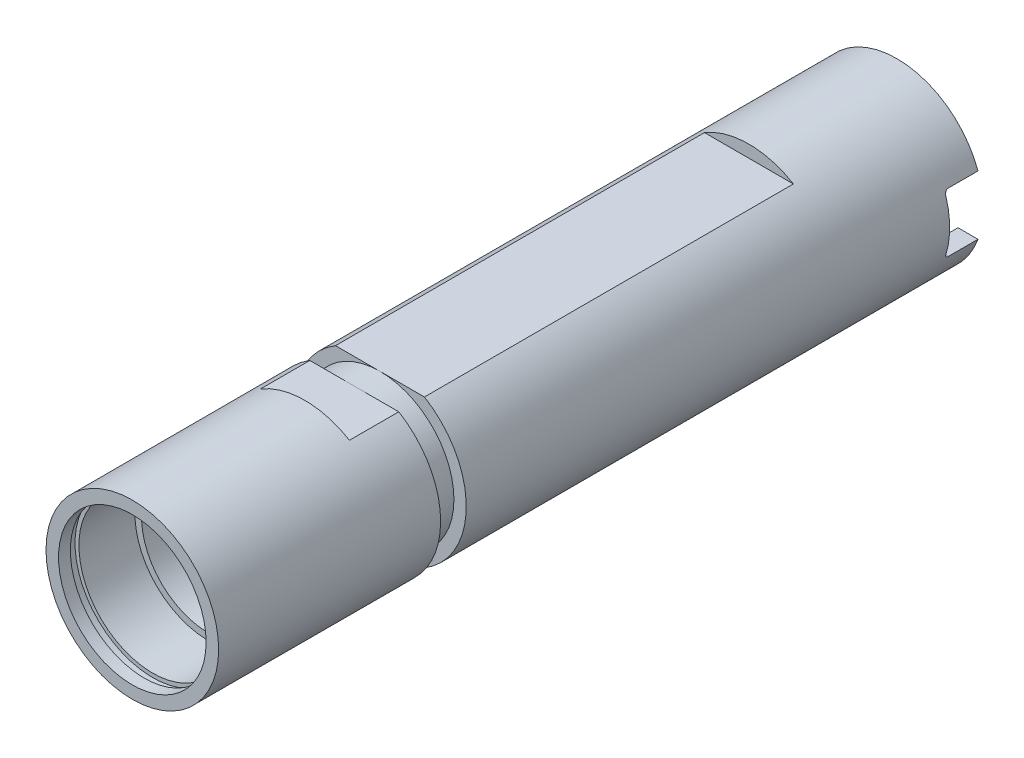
ISO-10303-21;
HEADER;
FILE_DESCRIPTION(('STEP AP214'),'2;1');
FILE_NAME('part.step','',(''),(''),'','','');
FILE_SCHEMA(('AUTOMOTIVE_DESIGN { 1 0 10303 214 1 1 1 1 }'));
ENDSEC;
DATA;
#1=APPLICATION_CONTEXT('core data for automotive mechanical design processes');
#2=APPLICATION_PROTOCOL_DEFINITION('international standard','automotive_design',2000,#1);
#3=PRODUCT_CONTEXT('',#1,'mechanical');
#4=PRODUCT('Part','Part','',(#3));
#5=PRODUCT_RELATED_PRODUCT_CATEGORY('part','',(#4));
#6=PRODUCT_DEFINITION_FORMATION('','',#4);
#7=PRODUCT_DEFINITION_CONTEXT('part definition',#1,'design');
#8=PRODUCT_DEFINITION('design','',#6,#7);
#9=PRODUCT_DEFINITION_SHAPE('','',#8);
#10=(LENGTH_UNIT() NAMED_UNIT(*) SI_UNIT(.MILLI.,.METRE.));
#11=(NAMED_UNIT(*) PLANE_ANGLE_UNIT() SI_UNIT($,.RADIAN.));
#12=(NAMED_UNIT(*) SI_UNIT($,.STERADIAN.) SOLID_ANGLE_UNIT());
#13=UNCERTAINTY_MEASURE_WITH_UNIT(LENGTH_MEASURE(1.E-05),#10,'distance_accuracy_value','');
#14=(GEOMETRIC_REPRESENTATION_CONTEXT(3) GLOBAL_UNCERTAINTY_ASSIGNED_CONTEXT((#13)) GLOBAL_UNIT_ASSIGNED_CONTEXT((#10,
#11,#12)) REPRESENTATION_CONTEXT('',''));
#15=CARTESIAN_POINT('',(0.,0.,0.));
#16=DIRECTION('',(0.,0.,1.));
#17=DIRECTION('',(1.,0.,0.));
#18=AXIS2_PLACEMENT_3D('',#15,#16,#17);
#19=CARTESIAN_POINT('',(0.,8.7376,-98.425));
#20=DIRECTION('',(0.,0.,1.));
#21=DIRECTION('',(1.,0.,0.));
#22=AXIS2_PLACEMENT_3D('',#19,#20,#21);
#23=PLANE('',#22);
#24=DIRECTION('',(-1.,0.,0.));
#25=VECTOR('',#24,1.);
#26=CARTESIAN_POINT('',(11.1125,3.81,-98.425));
#27=LINE('',#26,#25);
#28=CARTESIAN_POINT('',(10.4389442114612,3.81,-98.425));
#29=VERTEX_POINT('',#28);
#30=CARTESIAN_POINT('',(7.86317707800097,3.81,-98.425));
#31=VERTEX_POINT('',#30);
#32=EDGE_CURVE('E184',#29,#31,#27,.T.);
#33=ORIENTED_EDGE('',*,*,#32,.T.);
#34=CARTESIAN_POINT('',(0.,0.,-98.425));
#35=DIRECTION('',(0.,0.,1.));
#36=DIRECTION('',(1.,0.,0.));
#37=AXIS2_PLACEMENT_3D('',#34,#35,#36);
#38=CIRCLE('',#37,8.7376);
#39=CARTESIAN_POINT('',(7.86317707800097,-3.81000000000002,-98.425));
#40=VERTEX_POINT('',#39);
#41=EDGE_CURVE('E183',#31,#40,#38,.T.);
#42=ORIENTED_EDGE('',*,*,#41,.T.);
#43=DIRECTION('',(-1.,0.,0.));
#44=VECTOR('',#43,1.);
#45=CARTESIAN_POINT('',(11.1125,-3.81,-98.425));
#46=LINE('',#45,#44);
#47=CARTESIAN_POINT('',(10.4389442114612,-3.81,-98.425));
#48=VERTEX_POINT('',#47);
#49=EDGE_CURVE('E168',#48,#40,#46,.T.);
#50=ORIENTED_EDGE('',*,*,#49,.F.);
#51=CARTESIAN_POINT('',(0.,0.,-98.425));
#52=DIRECTION('',(0.,0.,1.));
#53=DIRECTION('',(1.,0.,0.));
#54=AXIS2_PLACEMENT_3D('',#51,#52,#53);
#55=CIRCLE('',#54,11.1125);
#56=EDGE_CURVE('E181',#29,#48,#55,.T.);
#57=ORIENTED_EDGE('',*,*,#56,.F.);
#58=EDGE_LOOP('',(#33,#42,#50,#57));
#59=FACE_BOUND('',#58,.T.);
#60=ADVANCED_FACE('F33',(#59),#23,.F.);
#61=CARTESIAN_POINT('',(0.,0.,67.4380733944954));
#62=DIRECTION('',(0.,0.,1.));
#63=DIRECTION('',(1.,0.,0.));
#64=AXIS2_PLACEMENT_3D('',#61,#62,#63);
#65=CYLINDRICAL_SURFACE('',#64,11.1125);
#66=CARTESIAN_POINT('',(0.,0.,-79.375));
#67=DIRECTION('',(0.,0.,-1.));
#68=DIRECTION('',(-1.,0.,0.));
#69=AXIS2_PLACEMENT_3D('',#66,#67,#68);
#70=CIRCLE('',#69,11.1125);
#71=CARTESIAN_POINT('',(5.72381264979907,-9.525,-79.375));
#72=VERTEX_POINT('',#71);
#73=CARTESIAN_POINT('',(-5.72381264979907,-9.525,-79.375));
#74=VERTEX_POINT('',#73);
#75=EDGE_CURVE('E215',#72,#74,#70,.T.);
#76=ORIENTED_EDGE('',*,*,#75,.T.);
#77=DIRECTION('',(0.,0.,1.));
#78=VECTOR('',#77,1.);
#79=CARTESIAN_POINT('',(-5.72381264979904,-9.52500000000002,67.4380733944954));
#80=LINE('',#79,#78);
#81=CARTESIAN_POINT('',(-5.72381264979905,-9.52500000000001,-31.877));
#82=VERTEX_POINT('',#81);
#83=EDGE_CURVE('E433',#74,#82,#80,.T.);
#84=ORIENTED_EDGE('',*,*,#83,.T.);
#85=CARTESIAN_POINT('',(0.,0.,-31.877));
#86=DIRECTION('',(0.,0.,1.));
#87=DIRECTION('',(1.,0.,0.));
#88=AXIS2_PLACEMENT_3D('',#85,#86,#87);
#89=CIRCLE('',#88,11.1125);
#90=CARTESIAN_POINT('',(-5.72381264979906,9.52500000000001,-31.877));
#91=VERTEX_POINT('',#90);
#92=EDGE_CURVE('E189',#91,#82,#89,.T.);
#93=ORIENTED_EDGE('',*,*,#92,.F.);
#94=DIRECTION('',(0.,0.,1.));
#95=VECTOR('',#94,1.);
#96=CARTESIAN_POINT('',(-5.72381264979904,9.52500000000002,67.4380733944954));
#97=LINE('',#96,#95);
#98=CARTESIAN_POINT('',(-5.72381264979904,9.525,-79.375));
#99=VERTEX_POINT('',#98);
#100=EDGE_CURVE('E423',#91,#99,#97,.F.);
#101=ORIENTED_EDGE('',*,*,#100,.T.);
#102=CARTESIAN_POINT('',(0.,0.,-79.375));
#103=DIRECTION('',(0.,0.,-1.));
#104=DIRECTION('',(-1.,0.,0.));
#105=AXIS2_PLACEMENT_3D('',#102,#103,#104);
#106=CIRCLE('',#105,11.1125);
#107=CARTESIAN_POINT('',(5.72381264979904,9.525,-79.375));
#108=VERTEX_POINT('',#107);
#109=EDGE_CURVE('E204',#99,#108,#106,.T.);
#110=ORIENTED_EDGE('',*,*,#109,.T.);
#111=DIRECTION('',(0.,0.,1.));
#112=VECTOR('',#111,1.);
#113=CARTESIAN_POINT('',(5.72381264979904,9.52500000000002,67.4380733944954));
#114=LINE('',#113,#112);
#115=CARTESIAN_POINT('',(5.72381264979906,9.52500000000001,-31.877));
#116=VERTEX_POINT('',#115);
#117=EDGE_CURVE('E425',#108,#116,#114,.T.);
#118=ORIENTED_EDGE('',*,*,#117,.T.);
#119=CARTESIAN_POINT('',(5.72381264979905,-9.52500000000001,-31.877));
#120=VERTEX_POINT('',#119);
#121=EDGE_CURVE('E195',#120,#116,#89,.T.);
#122=ORIENTED_EDGE('',*,*,#121,.F.);
#123=DIRECTION('',(0.,0.,1.));
#124=VECTOR('',#123,1.);
#125=CARTESIAN_POINT('',(5.72381264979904,-9.52500000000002,67.4380733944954));
#126=LINE('',#125,#124);
#127=EDGE_CURVE('E440',#120,#72,#126,.F.);
#128=ORIENTED_EDGE('',*,*,#127,.T.);
#129=EDGE_LOOP('',(#76,#84,#93,#101,#110,#118,#122,#128));
#130=FACE_BOUND('',#129,.T.);
#131=DIRECTION('',(0.,0.,1.));
#132=VECTOR('',#131,1.);
#133=CARTESIAN_POINT('',(10.4389442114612,3.81000000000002,67.4380733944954));
#134=LINE('',#133,#132);
#135=CARTESIAN_POINT('',(10.4389442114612,3.81000000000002,-94.615));
#136=VERTEX_POINT('',#135);
#137=EDGE_CURVE('E187',#29,#136,#134,.T.);
#138=ORIENTED_EDGE('',*,*,#137,.F.);
#139=ORIENTED_EDGE('',*,*,#56,.T.);
#140=DIRECTION('',(0.,0.,1.));
#141=VECTOR('',#140,1.);
#142=CARTESIAN_POINT('',(10.4389442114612,-3.81000000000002,67.4380733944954));
#143=LINE('',#142,#141);
#144=CARTESIAN_POINT('',(10.4389442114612,-3.81000000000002,-94.615));
#145=VERTEX_POINT('',#144);
#146=EDGE_CURVE('E164',#145,#48,#143,.F.);
#147=ORIENTED_EDGE('',*,*,#146,.F.);
#148=CARTESIAN_POINT('',(10.4389442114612,-3.81,-94.615));
#149=CARTESIAN_POINT('',(10.4389304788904,-3.81002917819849,-94.5876165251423));
#150=CARTESIAN_POINT('',(10.4397515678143,-3.80778787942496,-94.5602517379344));
#151=CARTESIAN_POINT('',(10.4429568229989,-3.79899298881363,-94.5063879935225));
#152=CARTESIAN_POINT('',(10.4453369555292,-3.79245052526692,-94.4798869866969));
#153=CARTESIAN_POINT('',(10.4515541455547,-3.77528145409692,-94.4284351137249));
#154=CARTESIAN_POINT('',(10.4553909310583,-3.76465560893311,-94.4034839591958));
#155=CARTESIAN_POINT('',(10.4643429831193,-3.73970032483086,-94.3557558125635));
#156=CARTESIAN_POINT('',(10.4694586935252,-3.72536960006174,-94.332979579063));
#157=CARTESIAN_POINT('',(10.4809141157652,-3.6930200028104,-94.2895452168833));
#158=CARTESIAN_POINT('',(10.487283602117,-3.6749105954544,-94.268962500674));
#159=CARTESIAN_POINT('',(10.500905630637,-3.63580330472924,-94.2310981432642));
#160=CARTESIAN_POINT('',(10.5081584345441,-3.61480456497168,-94.2138174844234));
#161=CARTESIAN_POINT('',(10.5237274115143,-3.56923360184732,-94.1820278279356));
#162=CARTESIAN_POINT('',(10.5320804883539,-3.544526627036,-94.1677301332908));
#163=CARTESIAN_POINT('',(10.5492163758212,-3.49319655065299,-94.143498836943));
#164=CARTESIAN_POINT('',(10.5579991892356,-3.46657343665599,-94.1335652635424));
#165=CARTESIAN_POINT('',(10.5741326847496,-3.41700518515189,-94.1196453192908));
#166=CARTESIAN_POINT('',(10.5814573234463,-3.39425808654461,-94.1149113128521));
#167=CARTESIAN_POINT('',(10.5960743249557,-3.3483510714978,-94.1085880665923));
#168=CARTESIAN_POINT('',(10.6033667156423,-3.32519167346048,-94.1069951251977));
#169=CARTESIAN_POINT('',(10.6105820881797,-3.302,-94.107));
#170=B_SPLINE_CURVE_WITH_KNOTS('',3,(#148,#149,#150,#151,#152,#153,#154,#155,#156,#157,#158,
#159,#160,#161,#162,#163,#164,#165,#166,#167,#168,#169),.UNSPECIFIED.,.F.,.F.,(4,2,2,2,2,2,2,2,
2,2,4),(0.,0.0820176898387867,0.163824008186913,0.245615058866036,0.327434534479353,
0.411502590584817,0.49559561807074,0.584431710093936,0.673268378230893,0.746152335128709,
0.818950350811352),.UNSPECIFIED.);
#171=CARTESIAN_POINT('',(10.6105820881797,-3.302,-94.107));
#172=VERTEX_POINT('',#171);
#173=EDGE_CURVE('E237',#145,#172,#170,.T.);
#174=ORIENTED_EDGE('',*,*,#173,.T.);
#175=CARTESIAN_POINT('',(0.,0.,-94.107));
#176=DIRECTION('',(0.,0.,-1.));
#177=DIRECTION('',(-1.,0.,0.));
#178=AXIS2_PLACEMENT_3D('',#175,#176,#177);
#179=CIRCLE('',#178,11.1125);
#180=CARTESIAN_POINT('',(10.6105820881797,3.302,-94.107));
#181=VERTEX_POINT('',#180);
#182=EDGE_CURVE('E343',#181,#172,#179,.T.);
#183=ORIENTED_EDGE('',*,*,#182,.F.);
#184=CARTESIAN_POINT('',(10.6105820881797,3.302,-94.107));
#185=CARTESIAN_POINT('',(10.6012948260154,3.3318605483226,-94.1069825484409));
#186=CARTESIAN_POINT('',(10.5918736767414,3.36167347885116,-94.1096317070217));
#187=CARTESIAN_POINT('',(10.5730531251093,3.42039836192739,-94.1200951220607));
#188=CARTESIAN_POINT('',(10.5636537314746,3.44930999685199,-94.1279111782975));
#189=CARTESIAN_POINT('',(10.5451673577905,3.50542200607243,-94.1485464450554));
#190=CARTESIAN_POINT('',(10.5360805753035,3.53262130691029,-94.1613687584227));
#191=CARTESIAN_POINT('',(10.5185506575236,3.5844798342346,-94.1917143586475));
#192=CARTESIAN_POINT('',(10.510107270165,3.60914005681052,-94.2092357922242));
#193=CARTESIAN_POINT('',(10.4943307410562,3.65475758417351,-94.2482414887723));
#194=CARTESIAN_POINT('',(10.4869814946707,3.67576956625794,-94.2696551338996));
#195=CARTESIAN_POINT('',(10.4735551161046,3.71385356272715,-94.3160993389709));
#196=CARTESIAN_POINT('',(10.4674779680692,3.73092562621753,-94.3411298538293));
#197=CARTESIAN_POINT('',(10.4571746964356,3.75970427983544,-94.3927394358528));
#198=CARTESIAN_POINT('',(10.4528704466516,3.77163872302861,-94.4191759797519));
#199=CARTESIAN_POINT('',(10.445914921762,3.7908605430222,-94.4738742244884));
#200=CARTESIAN_POINT('',(10.4432611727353,3.7981548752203,-94.5021331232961));
#201=CARTESIAN_POINT('',(10.4406535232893,3.80531412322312,-94.5447255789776));
#202=CARTESIAN_POINT('',(10.4400130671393,3.80707048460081,-94.558724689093));
#203=CARTESIAN_POINT('',(10.4391585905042,3.80941268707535,-94.5868133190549));
#204=CARTESIAN_POINT('',(10.4389439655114,3.81000018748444,-94.6009026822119));
#205=CARTESIAN_POINT('',(10.4389442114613,3.81000000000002,-94.615));
#206=B_SPLINE_CURVE_WITH_KNOTS('',3,(#184,#185,#186,#187,#188,#189,#190,#191,#192,#193,#194,
#195,#196,#197,#198,#199,#200,#201,#202,#203,#204,#205),.UNSPECIFIED.,.F.,.F.,(4,2,2,2,2,2,2,2,
2,2,4),(0.,0.0936956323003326,0.187423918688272,0.281210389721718,0.374959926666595,
0.467153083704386,0.55934509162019,0.646870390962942,0.734264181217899,0.77658675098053,
0.818849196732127),.UNSPECIFIED.);
#207=EDGE_CURVE('E11',#181,#136,#206,.T.);
#208=ORIENTED_EDGE('',*,*,#207,.T.);
#209=EDGE_LOOP('',(#138,#139,#147,#174,#183,#208));
#210=FACE_BOUND('',#209,.T.);
#211=ADVANCED_FACE('F186',(#130,#210),#65,.T.);
#212=CARTESIAN_POINT('',(0.,0.,67.4380733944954));
#213=DIRECTION('',(0.,0.,1.));
#214=DIRECTION('',(1.,0.,0.));
#215=AXIS2_PLACEMENT_3D('',#212,#213,#214);
#216=CYLINDRICAL_SURFACE('',#215,9.5631);
#217=DIRECTION('',(0.,0.,1.));
#218=VECTOR('',#217,1.);
#219=CARTESIAN_POINT('',(8.77136144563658,3.81000000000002,67.4380733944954));
#220=LINE('',#219,#218);
#221=CARTESIAN_POINT('',(8.77136144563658,3.81000000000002,-94.615));
#222=VERTEX_POINT('',#221);
#223=CARTESIAN_POINT('',(8.77136144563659,3.81,-95.885));
#224=VERTEX_POINT('',#223);
#225=EDGE_CURVE('E504',#222,#224,#220,.F.);
#226=ORIENTED_EDGE('',*,*,#225,.F.);
#227=CARTESIAN_POINT('',(8.77136144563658,3.81,-94.615));
#228=CARTESIAN_POINT('',(8.77134456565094,3.81003065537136,-94.588048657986));
#229=CARTESIAN_POINT('',(8.77229212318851,3.80785737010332,-94.5611201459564));
#230=CARTESIAN_POINT('',(8.77598321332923,3.7993470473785,-94.5081410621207));
#231=CARTESIAN_POINT('',(8.77872098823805,3.7930233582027,-94.482087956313));
#232=CARTESIAN_POINT('',(8.78585959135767,3.77645717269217,-94.4315209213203));
#233=CARTESIAN_POINT('',(8.79025969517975,3.76621638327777,-94.4070063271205));
#234=CARTESIAN_POINT('',(8.80050822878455,3.74220624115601,-94.3600944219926));
#235=CARTESIAN_POINT('',(8.8063574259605,3.72843501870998,-94.3376982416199));
#236=CARTESIAN_POINT('',(8.81949519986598,3.69725322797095,-94.294735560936));
#237=CARTESIAN_POINT('',(8.82682883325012,3.67972735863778,-94.2742667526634));
#238=CARTESIAN_POINT('',(8.84250104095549,3.64190553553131,-94.2365260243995));
#239=CARTESIAN_POINT('',(8.85083992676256,3.62160872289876,-94.2192550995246));
#240=CARTESIAN_POINT('',(8.86891696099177,3.57712347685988,-94.1870011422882));
#241=CARTESIAN_POINT('',(8.87871345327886,3.55275544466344,-94.1722985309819));
#242=CARTESIAN_POINT('',(8.89882157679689,3.5020850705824,-94.1472077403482));
#243=CARTESIAN_POINT('',(8.90913331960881,3.47578230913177,-94.1368205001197));
#244=CARTESIAN_POINT('',(8.92874997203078,3.42504794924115,-94.1215012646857));
#245=CARTESIAN_POINT('',(8.93803222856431,3.40075533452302,-94.1160747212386));
#246=CARTESIAN_POINT('',(8.95656069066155,3.35165687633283,-94.1088233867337));
#247=CARTESIAN_POINT('',(8.96580692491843,3.32685163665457,-94.1069945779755));
#248=CARTESIAN_POINT('',(8.97494722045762,3.302,-94.107));
#249=B_SPLINE_CURVE_WITH_KNOTS('',3,(#227,#228,#229,#230,#231,#232,#233,#234,#235,#236,#237,
#238,#239,#240,#241,#242,#243,#244,#245,#246,#247,#248),.UNSPECIFIED.,.F.,.F.,(4,2,2,2,2,2,2,2,
2,2,4),(0.,0.0807143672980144,0.161170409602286,0.241591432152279,0.322055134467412,
0.405480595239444,0.488931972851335,0.578840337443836,0.668768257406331,0.748219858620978,
0.827582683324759),.UNSPECIFIED.);
#250=CARTESIAN_POINT('',(8.97494722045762,3.302,-94.107));
#251=VERTEX_POINT('',#250);
#252=EDGE_CURVE('E47',#222,#251,#249,.T.);
#253=ORIENTED_EDGE('',*,*,#252,.T.);
#254=CARTESIAN_POINT('',(0.,0.,-94.107));
#255=DIRECTION('',(0.,0.,1.));
#256=DIRECTION('',(1.,0.,0.));
#257=AXIS2_PLACEMENT_3D('',#254,#255,#256);
#258=CIRCLE('',#257,9.5631);
#259=CARTESIAN_POINT('',(8.97494722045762,-3.302,-94.107));
#260=VERTEX_POINT('',#259);
#261=EDGE_CURVE('E349',#251,#260,#258,.T.);
#262=ORIENTED_EDGE('',*,*,#261,.T.);
#263=CARTESIAN_POINT('',(8.97494722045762,-3.302,-94.107));
#264=CARTESIAN_POINT('',(8.9637780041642,-3.3323765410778,-94.1069856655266));
#265=CARTESIAN_POINT('',(8.95244472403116,-3.36268720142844,-94.1097236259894));
#266=CARTESIAN_POINT('',(8.92979370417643,-3.42237545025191,-94.1205402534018));
#267=CARTESIAN_POINT('',(8.91847598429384,-3.45175226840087,-94.1286232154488));
#268=CARTESIAN_POINT('',(8.89621145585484,-3.50873894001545,-94.1499725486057));
#269=CARTESIAN_POINT('',(8.88526489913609,-3.53634760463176,-94.1632423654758));
#270=CARTESIAN_POINT('',(8.864151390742,-3.58894170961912,-94.1946834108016));
#271=CARTESIAN_POINT('',(8.85398407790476,-3.61392836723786,-94.2128523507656));
#272=CARTESIAN_POINT('',(8.83507947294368,-3.65989850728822,-94.2532180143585));
#273=CARTESIAN_POINT('',(8.82631405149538,-3.68096267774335,-94.2753093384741));
#274=CARTESIAN_POINT('',(8.81035104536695,-3.71900831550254,-94.3232746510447));
#275=CARTESIAN_POINT('',(8.80315324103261,-3.73599035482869,-94.3491481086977));
#276=CARTESIAN_POINT('',(8.79117838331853,-3.76407779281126,-94.4019755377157));
#277=CARTESIAN_POINT('',(8.78626587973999,-3.77551448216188,-94.4287228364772));
#278=CARTESIAN_POINT('',(8.77843671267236,-3.79368291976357,-94.4840233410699));
#279=CARTESIAN_POINT('',(8.77551629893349,-3.80042350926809,-94.5125730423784));
#280=CARTESIAN_POINT('',(8.77290893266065,-3.80643577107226,-94.5536764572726));
#281=CARTESIAN_POINT('',(8.7723289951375,-3.80777189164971,-94.5659042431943));
#282=CARTESIAN_POINT('',(8.77155554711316,-3.80955320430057,-94.590419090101));
#283=CARTESIAN_POINT('',(8.77136148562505,-3.80999966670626,-94.6027060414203));
#284=CARTESIAN_POINT('',(8.77136144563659,-3.81,-94.615));
#285=B_SPLINE_CURVE_WITH_KNOTS('',3,(#263,#264,#265,#266,#267,#268,#269,#270,#271,#272,#273,
#274,#275,#276,#277,#278,#279,#280,#281,#282,#283,#284),.UNSPECIFIED.,.F.,.F.,(4,2,2,2,2,2,2,2,
2,2,4),(0.,0.0969735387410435,0.194025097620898,0.291141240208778,0.38821209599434,
0.482987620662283,0.577749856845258,0.66579338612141,0.753670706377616,0.790581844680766,
0.827440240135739),.UNSPECIFIED.);
#286=CARTESIAN_POINT('',(8.77136144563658,-3.81000000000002,-94.615));
#287=VERTEX_POINT('',#286);
#288=EDGE_CURVE('E230',#260,#287,#285,.T.);
#289=ORIENTED_EDGE('',*,*,#288,.T.);
#290=DIRECTION('',(0.,0.,1.));
#291=VECTOR('',#290,1.);
#292=CARTESIAN_POINT('',(8.77136144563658,-3.81000000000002,67.4380733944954));
#293=LINE('',#292,#291);
#294=CARTESIAN_POINT('',(8.77136144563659,-3.81,-95.885));
#295=VERTEX_POINT('',#294);
#296=EDGE_CURVE('E175',#295,#287,#293,.T.);
#297=ORIENTED_EDGE('',*,*,#296,.F.);
#298=CARTESIAN_POINT('',(0.,0.,-95.885));
#299=DIRECTION('',(0.,0.,1.));
#300=DIRECTION('',(1.,0.,0.));
#301=AXIS2_PLACEMENT_3D('',#298,#299,#300);
#302=CIRCLE('',#301,9.5631);
#303=EDGE_CURVE('E354',#224,#295,#302,.T.);
#304=ORIENTED_EDGE('',*,*,#303,.F.);
#305=EDGE_LOOP('',(#226,#253,#262,#289,#297,#304));
#306=FACE_BOUND('',#305,.T.);
#307=ADVANCED_FACE('F242',(#306),#216,.F.);
#308=CARTESIAN_POINT('',(0.,9.5631,-95.885));
#309=DIRECTION('',(0.,0.,-1.));
#310=DIRECTION('',(-1.,0.,0.));
#311=AXIS2_PLACEMENT_3D('',#308,#309,#310);
#312=PLANE('',#311);
#313=DIRECTION('',(-1.,0.,0.));
#314=VECTOR('',#313,1.);
#315=CARTESIAN_POINT('',(0.,3.81,-95.885));
#316=LINE('',#315,#314);
#317=CARTESIAN_POINT('',(7.86317707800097,3.81000000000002,-95.885));
#318=VERTEX_POINT('',#317);
#319=EDGE_CURVE('E174',#224,#318,#316,.T.);
#320=ORIENTED_EDGE('',*,*,#319,.F.);
#321=ORIENTED_EDGE('',*,*,#303,.T.);
#322=DIRECTION('',(1.,0.,0.));
#323=VECTOR('',#322,1.);
#324=CARTESIAN_POINT('',(0.,-3.81,-95.885));
#325=LINE('',#324,#323);
#326=CARTESIAN_POINT('',(7.86317707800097,-3.81000000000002,-95.885));
#327=VERTEX_POINT('',#326);
#328=EDGE_CURVE('E500',#327,#295,#325,.T.);
#329=ORIENTED_EDGE('',*,*,#328,.F.);
#330=CARTESIAN_POINT('',(0.,0.,-95.885));
#331=DIRECTION('',(0.,0.,1.));
#332=DIRECTION('',(1.,0.,0.));
#333=AXIS2_PLACEMENT_3D('',#330,#331,#332);
#334=CIRCLE('',#333,8.7376);
#335=EDGE_CURVE('E491',#318,#327,#334,.T.);
#336=ORIENTED_EDGE('',*,*,#335,.F.);
#337=EDGE_LOOP('',(#320,#321,#329,#336));
#338=FACE_BOUND('',#337,.T.);
#339=ADVANCED_FACE('F498',(#338),#312,.F.);
#340=CARTESIAN_POINT('',(0.,0.,67.4380733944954));
#341=DIRECTION('',(0.,0.,1.));
#342=DIRECTION('',(1.,0.,0.));
#343=AXIS2_PLACEMENT_3D('',#340,#341,#342);
#344=CYLINDRICAL_SURFACE('',#343,8.7376);
#345=DIRECTION('',(0.,0.,1.));
#346=VECTOR('',#345,1.);
#347=CARTESIAN_POINT('',(7.86317707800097,3.81000000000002,67.4380733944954));
#348=LINE('',#347,#346);
#349=EDGE_CURVE('E220',#318,#31,#348,.F.);
#350=ORIENTED_EDGE('',*,*,#349,.F.);
#351=ORIENTED_EDGE('',*,*,#335,.T.);
#352=DIRECTION('',(0.,0.,1.));
#353=VECTOR('',#352,1.);
#354=CARTESIAN_POINT('',(7.86317707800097,-3.81000000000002,67.4380733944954));
#355=LINE('',#354,#353);
#356=EDGE_CURVE('E218',#40,#327,#355,.T.);
#357=ORIENTED_EDGE('',*,*,#356,.F.);
#358=ORIENTED_EDGE('',*,*,#41,.F.);
#359=EDGE_LOOP('',(#350,#351,#357,#358));
#360=FACE_BOUND('',#359,.T.);
#361=ADVANCED_FACE('F567',(#360),#344,.F.);
#362=CARTESIAN_POINT('',(0.,9.525,-31.877));
#363=DIRECTION('',(0.,0.,1.));
#364=DIRECTION('',(1.,0.,0.));
#365=AXIS2_PLACEMENT_3D('',#362,#363,#364);
#366=PLANE('',#365);
#367=DIRECTION('',(-1.,0.,0.));
#368=VECTOR('',#367,1.);
#369=CARTESIAN_POINT('',(0.,-9.52500000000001,-31.877));
#370=LINE('',#369,#368);
#371=CARTESIAN_POINT('',(0.,-9.525,-31.877));
#372=VERTEX_POINT('',#371);
#373=EDGE_CURVE('E436',#120,#372,#370,.T.);
#374=ORIENTED_EDGE('',*,*,#373,.F.);
#375=ORIENTED_EDGE('',*,*,#121,.T.);
#376=DIRECTION('',(1.,0.,0.));
#377=VECTOR('',#376,1.);
#378=CARTESIAN_POINT('',(0.,9.52500000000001,-31.877));
#379=LINE('',#378,#377);
#380=CARTESIAN_POINT('',(0.,9.525,-31.877));
#381=VERTEX_POINT('',#380);
#382=EDGE_CURVE('E419',#381,#116,#379,.T.);
#383=ORIENTED_EDGE('',*,*,#382,.F.);
#384=CARTESIAN_POINT('',(0.,0.,-31.877));
#385=DIRECTION('',(0.,0.,1.));
#386=DIRECTION('',(1.,0.,0.));
#387=AXIS2_PLACEMENT_3D('',#384,#385,#386);
#388=CIRCLE('',#387,9.525);
#389=EDGE_CURVE('E403',#372,#381,#388,.T.);
#390=ORIENTED_EDGE('',*,*,#389,.F.);
#391=EDGE_LOOP('',(#374,#375,#383,#390));
#392=FACE_BOUND('',#391,.T.);
#393=ADVANCED_FACE('F264',(#392),#366,.T.);
#394=CARTESIAN_POINT('',(0.,11.1125,-28.575));
#395=DIRECTION('',(0.,0.,-1.));
#396=DIRECTION('',(-1.,0.,0.));
#397=AXIS2_PLACEMENT_3D('',#394,#395,#396);
#398=PLANE('',#397);
#399=DIRECTION('',(1.,0.,0.));
#400=VECTOR('',#399,1.);
#401=CARTESIAN_POINT('',(0.,-9.52500000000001,-28.575));
#402=LINE('',#401,#400);
#403=CARTESIAN_POINT('',(-5.72381264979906,-9.52500000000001,-28.575));
#404=VERTEX_POINT('',#403);
#405=CARTESIAN_POINT('',(0.,-9.52500000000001,-28.575));
#406=VERTEX_POINT('',#405);
#407=EDGE_CURVE('E434',#404,#406,#402,.T.);
#408=ORIENTED_EDGE('',*,*,#407,.F.);
#409=CARTESIAN_POINT('',(0.,0.,-28.575));
#410=DIRECTION('',(0.,0.,1.));
#411=DIRECTION('',(1.,0.,0.));
#412=AXIS2_PLACEMENT_3D('',#409,#410,#411);
#413=CIRCLE('',#412,11.1125);
#414=CARTESIAN_POINT('',(-5.72381264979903,9.52500000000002,-28.575));
#415=VERTEX_POINT('',#414);
#416=EDGE_CURVE('E397',#415,#404,#413,.T.);
#417=ORIENTED_EDGE('',*,*,#416,.F.);
#418=DIRECTION('',(-1.,0.,0.));
#419=VECTOR('',#418,1.);
#420=CARTESIAN_POINT('',(0.,9.52500000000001,-28.575));
#421=LINE('',#420,#419);
#422=CARTESIAN_POINT('',(0.,9.52500000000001,-28.575));
#423=VERTEX_POINT('',#422);
#424=EDGE_CURVE('E449',#423,#415,#421,.T.);
#425=ORIENTED_EDGE('',*,*,#424,.F.);
#426=CARTESIAN_POINT('',(0.,0.,-28.575));
#427=DIRECTION('',(0.,0.,1.));
#428=DIRECTION('',(1.,0.,0.));
#429=AXIS2_PLACEMENT_3D('',#426,#427,#428);
#430=CIRCLE('',#429,9.525);
#431=EDGE_CURVE('E401',#423,#406,#430,.T.);
#432=ORIENTED_EDGE('',*,*,#431,.T.);
#433=EDGE_LOOP('',(#408,#417,#425,#432));
#434=FACE_BOUND('',#433,.T.);
#435=ADVANCED_FACE('F262',(#434),#398,.T.);
#436=EDGE_CURVE('E430',#372,#82,#370,.T.);
#437=ORIENTED_EDGE('',*,*,#436,.F.);
#438=EDGE_CURVE('E404',#381,#372,#388,.T.);
#439=ORIENTED_EDGE('',*,*,#438,.F.);
#440=EDGE_CURVE('E416',#91,#381,#379,.T.);
#441=ORIENTED_EDGE('',*,*,#440,.F.);
#442=ORIENTED_EDGE('',*,*,#92,.T.);
#443=EDGE_LOOP('',(#437,#439,#441,#442));
#444=FACE_BOUND('',#443,.T.);
#445=ADVANCED_FACE('F257',(#444),#366,.T.);
#446=CARTESIAN_POINT('',(0.,0.,67.4380733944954));
#447=DIRECTION('',(0.,0.,1.));
#448=DIRECTION('',(1.,0.,0.));
#449=AXIS2_PLACEMENT_3D('',#446,#447,#448);
#450=CYLINDRICAL_SURFACE('',#449,9.525);
#451=ORIENTED_EDGE('',*,*,#438,.T.);
#452=ORIENTED_EDGE('',*,*,#389,.T.);
#453=EDGE_LOOP('',(#451,#452));
#454=FACE_BOUND('',#453,.T.);
#455=ORIENTED_EDGE('',*,*,#431,.F.);
#456=EDGE_CURVE('E400',#406,#423,#430,.T.);
#457=ORIENTED_EDGE('',*,*,#456,.F.);
#458=EDGE_LOOP('',(#455,#457));
#459=FACE_BOUND('',#458,.T.);
#460=ADVANCED_FACE('F261',(#454,#459),#450,.T.);
#461=CARTESIAN_POINT('',(5.72381264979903,-9.52500000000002,-28.575));
#462=VERTEX_POINT('',#461);
#463=EDGE_CURVE('E438',#406,#462,#402,.T.);
#464=ORIENTED_EDGE('',*,*,#463,.F.);
#465=ORIENTED_EDGE('',*,*,#456,.T.);
#466=CARTESIAN_POINT('',(5.72381264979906,9.52500000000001,-28.575));
#467=VERTEX_POINT('',#466);
#468=EDGE_CURVE('E428',#467,#423,#421,.T.);
#469=ORIENTED_EDGE('',*,*,#468,.F.);
#470=EDGE_CURVE('E396',#462,#467,#413,.T.);
#471=ORIENTED_EDGE('',*,*,#470,.F.);
#472=EDGE_LOOP('',(#464,#465,#469,#471));
#473=FACE_BOUND('',#472,.T.);
#474=ADVANCED_FACE('F267',(#473),#398,.T.);
#475=CARTESIAN_POINT('',(0.,0.,67.4380733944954));
#476=DIRECTION('',(0.,0.,1.));
#477=DIRECTION('',(1.,0.,0.));
#478=AXIS2_PLACEMENT_3D('',#475,#476,#477);
#479=CYLINDRICAL_SURFACE('',#478,11.1125);
#480=DIRECTION('',(0.,0.,1.));
#481=VECTOR('',#480,1.);
#482=CARTESIAN_POINT('',(-5.72381264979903,-9.52500000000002,67.4380733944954));
#483=LINE('',#482,#481);
#484=CARTESIAN_POINT('',(-5.72381264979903,-9.52500000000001,-22.225));
#485=VERTEX_POINT('',#484);
#486=EDGE_CURVE('E212',#404,#485,#483,.T.);
#487=ORIENTED_EDGE('',*,*,#486,.T.);
#488=CARTESIAN_POINT('',(0.,0.,-22.225));
#489=DIRECTION('',(0.,0.,1.));
#490=DIRECTION('',(0.,-1.,0.));
#491=AXIS2_PLACEMENT_3D('',#488,#489,#490);
#492=CIRCLE('',#491,11.1125);
#493=CARTESIAN_POINT('',(5.72381264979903,-9.52500000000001,-22.225));
#494=VERTEX_POINT('',#493);
#495=EDGE_CURVE('E209',#485,#494,#492,.T.);
#496=ORIENTED_EDGE('',*,*,#495,.T.);
#497=DIRECTION('',(0.,0.,1.));
#498=VECTOR('',#497,1.);
#499=CARTESIAN_POINT('',(5.72381264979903,-9.52500000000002,67.4380733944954));
#500=LINE('',#499,#498);
#501=EDGE_CURVE('E206',#494,#462,#500,.F.);
#502=ORIENTED_EDGE('',*,*,#501,.T.);
#503=ORIENTED_EDGE('',*,*,#470,.T.);
#504=DIRECTION('',(0.,0.,1.));
#505=VECTOR('',#504,1.);
#506=CARTESIAN_POINT('',(5.72381264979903,9.52500000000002,67.4380733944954));
#507=LINE('',#506,#505);
#508=CARTESIAN_POINT('',(5.72381264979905,9.52500000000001,-22.225));
#509=VERTEX_POINT('',#508);
#510=EDGE_CURVE('E201',#467,#509,#507,.T.);
#511=ORIENTED_EDGE('',*,*,#510,.T.);
#512=CARTESIAN_POINT('',(0.,0.,-22.225));
#513=DIRECTION('',(0.,0.,1.));
#514=DIRECTION('',(0.,-1.,0.));
#515=AXIS2_PLACEMENT_3D('',#512,#513,#514);
#516=CIRCLE('',#515,11.1125);
#517=CARTESIAN_POINT('',(-5.72381264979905,9.52500000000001,-22.225));
#518=VERTEX_POINT('',#517);
#519=EDGE_CURVE('E188',#509,#518,#516,.T.);
#520=ORIENTED_EDGE('',*,*,#519,.T.);
#521=DIRECTION('',(0.,0.,1.));
#522=VECTOR('',#521,1.);
#523=CARTESIAN_POINT('',(-5.72381264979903,9.52500000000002,67.4380733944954));
#524=LINE('',#523,#522);
#525=EDGE_CURVE('E192',#518,#415,#524,.F.);
#526=ORIENTED_EDGE('',*,*,#525,.T.);
#527=ORIENTED_EDGE('',*,*,#416,.T.);
#528=EDGE_LOOP('',(#487,#496,#502,#503,#511,#520,#526,#527));
#529=FACE_BOUND('',#528,.T.);
#530=CARTESIAN_POINT('',(0.,0.,0.));
#531=DIRECTION('',(0.,0.,1.));
#532=DIRECTION('',(1.,0.,0.));
#533=AXIS2_PLACEMENT_3D('',#530,#531,#532);
#534=CIRCLE('',#533,11.1125);
#535=CARTESIAN_POINT('',(11.1125,0.,0.));
#536=VERTEX_POINT('',#535);
#537=EDGE_CURVE('E393',#536,#536,#534,.T.);
#538=ORIENTED_EDGE('',*,*,#537,.F.);
#539=EDGE_LOOP('',(#538));
#540=FACE_BOUND('',#539,.T.);
#541=ADVANCED_FACE('F271',(#529,#540),#479,.T.);
#542=CARTESIAN_POINT('',(0.,11.1125,0.));
#543=DIRECTION('',(0.,0.,-1.));
#544=DIRECTION('',(-1.,0.,0.));
#545=AXIS2_PLACEMENT_3D('',#542,#543,#544);
#546=PLANE('',#545);
#547=CARTESIAN_POINT('',(0.,0.,0.));
#548=DIRECTION('',(0.,0.,1.));
#549=DIRECTION('',(1.,0.,0.));
#550=AXIS2_PLACEMENT_3D('',#547,#548,#549);
#551=CIRCLE('',#550,9.5);
#552=CARTESIAN_POINT('',(9.5,0.,0.));
#553=VERTEX_POINT('',#552);
#554=EDGE_CURVE('E390',#553,#553,#551,.T.);
#555=ORIENTED_EDGE('',*,*,#554,.F.);
#556=EDGE_LOOP('',(#555));
#557=FACE_BOUND('',#556,.T.);
#558=ORIENTED_EDGE('',*,*,#537,.T.);
#559=EDGE_LOOP('',(#558));
#560=FACE_BOUND('',#559,.T.);
#561=ADVANCED_FACE('F275',(#557,#560),#546,.F.);
#562=CARTESIAN_POINT('',(0.,0.,67.4380733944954));
#563=DIRECTION('',(0.,0.,1.));
#564=DIRECTION('',(1.,0.,0.));
#565=AXIS2_PLACEMENT_3D('',#562,#563,#564);
#566=CYLINDRICAL_SURFACE('',#565,9.5);
#567=CARTESIAN_POINT('',(0.,0.,-1.524));
#568=DIRECTION('',(0.,0.,1.));
#569=DIRECTION('',(1.,0.,0.));
#570=AXIS2_PLACEMENT_3D('',#567,#568,#569);
#571=CIRCLE('',#570,9.5);
#572=CARTESIAN_POINT('',(9.5,0.,-1.524));
#573=VERTEX_POINT('',#572);
#574=EDGE_CURVE('E387',#573,#573,#571,.T.);
#575=ORIENTED_EDGE('',*,*,#574,.F.);
#576=EDGE_LOOP('',(#575));
#577=FACE_BOUND('',#576,.T.);
#578=ORIENTED_EDGE('',*,*,#554,.T.);
#579=EDGE_LOOP('',(#578));
#580=FACE_BOUND('',#579,.T.);
#581=ADVANCED_FACE('F279',(#577,#580),#566,.F.);
#582=CARTESIAN_POINT('',(0.,9.5,-1.524));
#583=DIRECTION('',(0.,0.,1.));
#584=DIRECTION('',(1.,0.,0.));
#585=AXIS2_PLACEMENT_3D('',#582,#583,#584);
#586=PLANE('',#585);
#587=CARTESIAN_POINT('',(0.,0.,-1.524));
#588=DIRECTION('',(0.,0.,1.));
#589=DIRECTION('',(1.,0.,0.));
#590=AXIS2_PLACEMENT_3D('',#587,#588,#589);
#591=CIRCLE('',#590,10.);
#592=CARTESIAN_POINT('',(10.,0.,-1.524));
#593=VERTEX_POINT('',#592);
#594=EDGE_CURVE('E384',#593,#593,#591,.T.);
#595=ORIENTED_EDGE('',*,*,#594,.F.);
#596=EDGE_LOOP('',(#595));
#597=FACE_BOUND('',#596,.T.);
#598=ORIENTED_EDGE('',*,*,#574,.T.);
#599=EDGE_LOOP('',(#598));
#600=FACE_BOUND('',#599,.T.);
#601=ADVANCED_FACE('F283',(#597,#600),#586,.F.);
#602=CARTESIAN_POINT('',(0.,0.,67.4380733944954));
#603=DIRECTION('',(0.,0.,1.));
#604=DIRECTION('',(1.,0.,0.));
#605=AXIS2_PLACEMENT_3D('',#602,#603,#604);
#606=CYLINDRICAL_SURFACE('',#605,10.);
#607=CARTESIAN_POINT('',(0.,0.,-2.624));
#608=DIRECTION('',(0.,0.,1.));
#609=DIRECTION('',(1.,0.,0.));
#610=AXIS2_PLACEMENT_3D('',#607,#608,#609);
#611=CIRCLE('',#610,10.);
#612=CARTESIAN_POINT('',(10.,0.,-2.624));
#613=VERTEX_POINT('',#612);
#614=EDGE_CURVE('E381',#613,#613,#611,.T.);
#615=ORIENTED_EDGE('',*,*,#614,.F.);
#616=EDGE_LOOP('',(#615));
#617=FACE_BOUND('',#616,.T.);
#618=ORIENTED_EDGE('',*,*,#594,.T.);
#619=EDGE_LOOP('',(#618));
#620=FACE_BOUND('',#619,.T.);
#621=ADVANCED_FACE('F287',(#617,#620),#606,.F.);
#622=CARTESIAN_POINT('',(0.,10.,-2.624));
#623=DIRECTION('',(0.,0.,-1.));
#624=DIRECTION('',(-1.,0.,0.));
#625=AXIS2_PLACEMENT_3D('',#622,#623,#624);
#626=PLANE('',#625);
#627=CARTESIAN_POINT('',(0.,0.,-2.624));
#628=DIRECTION('',(0.,0.,1.));
#629=DIRECTION('',(1.,0.,0.));
#630=AXIS2_PLACEMENT_3D('',#627,#628,#629);
#631=CIRCLE('',#630,9.5);
#632=CARTESIAN_POINT('',(9.5,0.,-2.624));
#633=VERTEX_POINT('',#632);
#634=EDGE_CURVE('E378',#633,#633,#631,.T.);
#635=ORIENTED_EDGE('',*,*,#634,.F.);
#636=EDGE_LOOP('',(#635));
#637=FACE_BOUND('',#636,.T.);
#638=ORIENTED_EDGE('',*,*,#614,.T.);
#639=EDGE_LOOP('',(#638));
#640=FACE_BOUND('',#639,.T.);
#641=ADVANCED_FACE('F291',(#637,#640),#626,.F.);
#642=CARTESIAN_POINT('',(0.,0.,67.4380733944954));
#643=DIRECTION('',(0.,0.,1.));
#644=DIRECTION('',(1.,0.,0.));
#645=AXIS2_PLACEMENT_3D('',#642,#643,#644);
#646=CYLINDRICAL_SURFACE('',#645,9.5);
#647=CARTESIAN_POINT('',(0.,0.,-9.824));
#648=DIRECTION('',(0.,0.,1.));
#649=DIRECTION('',(1.,0.,0.));
#650=AXIS2_PLACEMENT_3D('',#647,#648,#649);
#651=CIRCLE('',#650,9.5);
#652=CARTESIAN_POINT('',(9.5,0.,-9.824));
#653=VERTEX_POINT('',#652);
#654=EDGE_CURVE('E375',#653,#653,#651,.T.);
#655=ORIENTED_EDGE('',*,*,#654,.F.);
#656=EDGE_LOOP('',(#655));
#657=FACE_BOUND('',#656,.T.);
#658=ORIENTED_EDGE('',*,*,#634,.T.);
#659=EDGE_LOOP('',(#658));
#660=FACE_BOUND('',#659,.T.);
#661=ADVANCED_FACE('F295',(#657,#660),#646,.F.);
#662=CARTESIAN_POINT('',(0.,9.5,-9.824));
#663=DIRECTION('',(0.,0.,-1.));
#664=DIRECTION('',(-1.,0.,0.));
#665=AXIS2_PLACEMENT_3D('',#662,#663,#664);
#666=PLANE('',#665);
#667=CARTESIAN_POINT('',(0.,0.,-9.824));
#668=DIRECTION('',(0.,0.,1.));
#669=DIRECTION('',(1.,0.,0.));
#670=AXIS2_PLACEMENT_3D('',#667,#668,#669);
#671=CIRCLE('',#670,8.636);
#672=CARTESIAN_POINT('',(8.636,0.,-9.824));
#673=VERTEX_POINT('',#672);
#674=EDGE_CURVE('E372',#673,#673,#671,.T.);
#675=ORIENTED_EDGE('',*,*,#674,.F.);
#676=EDGE_LOOP('',(#675));
#677=FACE_BOUND('',#676,.T.);
#678=ORIENTED_EDGE('',*,*,#654,.T.);
#679=EDGE_LOOP('',(#678));
#680=FACE_BOUND('',#679,.T.);
#681=ADVANCED_FACE('F299',(#677,#680),#666,.F.);
#682=CARTESIAN_POINT('',(0.,0.,67.4380733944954));
#683=DIRECTION('',(0.,0.,1.));
#684=DIRECTION('',(1.,0.,0.));
#685=AXIS2_PLACEMENT_3D('',#682,#683,#684);
#686=CYLINDRICAL_SURFACE('',#685,8.636);
#687=CARTESIAN_POINT('',(0.,0.,-16.174));
#688=DIRECTION('',(0.,0.,1.));
#689=DIRECTION('',(1.,0.,0.));
#690=AXIS2_PLACEMENT_3D('',#687,#688,#689);
#691=CIRCLE('',#690,8.636);
#692=CARTESIAN_POINT('',(8.636,0.,-16.174));
#693=VERTEX_POINT('',#692);
#694=EDGE_CURVE('E369',#693,#693,#691,.T.);
#695=ORIENTED_EDGE('',*,*,#694,.F.);
#696=EDGE_LOOP('',(#695));
#697=FACE_BOUND('',#696,.T.);
#698=ORIENTED_EDGE('',*,*,#674,.T.);
#699=EDGE_LOOP('',(#698));
#700=FACE_BOUND('',#699,.T.);
#701=ADVANCED_FACE('F303',(#697,#700),#686,.F.);
#702=CARTESIAN_POINT('',(0.,8.636,-16.174));
#703=DIRECTION('',(0.,0.,-1.));
#704=DIRECTION('',(-1.,0.,0.));
#705=AXIS2_PLACEMENT_3D('',#702,#703,#704);
#706=PLANE('',#705);
#707=CARTESIAN_POINT('',(-5.62916512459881,3.25000000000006,-16.174));
#708=DIRECTION('',(0.,0.,1.));
#709=DIRECTION('',(1.,0.,0.));
#710=AXIS2_PLACEMENT_3D('',#707,#708,#709);
#711=CIRCLE('',#710,1.);
#712=CARTESIAN_POINT('',(-4.62916512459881,3.25000000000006,-16.174));
#713=VERTEX_POINT('',#712);
#714=EDGE_CURVE('E454',#713,#713,#711,.T.);
#715=ORIENTED_EDGE('',*,*,#714,.F.);
#716=EDGE_LOOP('',(#715));
#717=FACE_BOUND('',#716,.T.);
#718=CARTESIAN_POINT('',(-5.62916512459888,-3.24999999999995,-16.174));
#719=DIRECTION('',(0.,0.,1.));
#720=DIRECTION('',(1.,0.,0.));
#721=AXIS2_PLACEMENT_3D('',#718,#719,#720);
#722=CIRCLE('',#721,1.);
#723=CARTESIAN_POINT('',(-4.62916512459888,-3.24999999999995,-16.174));
#724=VERTEX_POINT('',#723);
#725=EDGE_CURVE('E460',#724,#724,#722,.T.);
#726=ORIENTED_EDGE('',*,*,#725,.F.);
#727=EDGE_LOOP('',(#726));
#728=FACE_BOUND('',#727,.T.);
#729=CARTESIAN_POINT('',(5.62916512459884,-3.25000000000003,-16.174));
#730=DIRECTION('',(0.,0.,1.));
#731=DIRECTION('',(1.,0.,0.));
#732=AXIS2_PLACEMENT_3D('',#729,#730,#731);
#733=CIRCLE('',#732,1.00000000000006);
#734=CARTESIAN_POINT('',(6.6291651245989,-3.25000000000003,-16.174));
#735=VERTEX_POINT('',#734);
#736=EDGE_CURVE('E466',#735,#735,#733,.T.);
#737=ORIENTED_EDGE('',*,*,#736,.F.);
#738=EDGE_LOOP('',(#737));
#739=FACE_BOUND('',#738,.T.);
#740=CARTESIAN_POINT('',(5.6291651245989,3.24999999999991,-16.174));
#741=DIRECTION('',(0.,0.,1.));
#742=DIRECTION('',(1.,0.,0.));
#743=AXIS2_PLACEMENT_3D('',#740,#741,#742);
#744=CIRCLE('',#743,1.00000000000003);
#745=CARTESIAN_POINT('',(6.62916512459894,3.24999999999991,-16.174));
#746=VERTEX_POINT('',#745);
#747=EDGE_CURVE('E472',#746,#746,#744,.T.);
#748=ORIENTED_EDGE('',*,*,#747,.F.);
#749=EDGE_LOOP('',(#748));
#750=FACE_BOUND('',#749,.T.);
#751=CARTESIAN_POINT('',(0.,-6.5,-16.174));
#752=DIRECTION('',(0.,0.,1.));
#753=DIRECTION('',(1.,0.,0.));
#754=AXIS2_PLACEMENT_3D('',#751,#752,#753);
#755=CIRCLE('',#754,1.);
#756=CARTESIAN_POINT('',(0.999999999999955,-6.5,-16.174));
#757=VERTEX_POINT('',#756);
#758=EDGE_CURVE('E478',#757,#757,#755,.T.);
#759=ORIENTED_EDGE('',*,*,#758,.F.);
#760=EDGE_LOOP('',(#759));
#761=FACE_BOUND('',#760,.T.);
#762=CARTESIAN_POINT('',(0.,6.5,-16.174));
#763=DIRECTION('',(0.,0.,1.));
#764=DIRECTION('',(1.,0.,0.));
#765=AXIS2_PLACEMENT_3D('',#762,#763,#764);
#766=CIRCLE('',#765,1.);
#767=CARTESIAN_POINT('',(1.,6.5,-16.174));
#768=VERTEX_POINT('',#767);
#769=EDGE_CURVE('E484',#768,#768,#766,.T.);
#770=ORIENTED_EDGE('',*,*,#769,.F.);
#771=EDGE_LOOP('',(#770));
#772=FACE_BOUND('',#771,.T.);
#773=CARTESIAN_POINT('',(0.,0.,-16.174));
#774=DIRECTION('',(0.,0.,1.));
#775=DIRECTION('',(1.,0.,0.));
#776=AXIS2_PLACEMENT_3D('',#773,#774,#775);
#777=CIRCLE('',#776,5.0038);
#778=CARTESIAN_POINT('',(5.0038,0.,-16.174));
#779=VERTEX_POINT('',#778);
#780=EDGE_CURVE('E366',#779,#779,#777,.T.);
#781=ORIENTED_EDGE('',*,*,#780,.F.);
#782=EDGE_LOOP('',(#781));
#783=FACE_BOUND('',#782,.T.);
#784=ORIENTED_EDGE('',*,*,#694,.T.);
#785=EDGE_LOOP('',(#784));
#786=FACE_BOUND('',#785,.T.);
#787=ADVANCED_FACE('F307',(#717,#728,#739,#750,#761,#772,#783,#786),#706,.F.);
#788=CARTESIAN_POINT('',(0.,0.,67.4380733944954));
#789=DIRECTION('',(0.,0.,1.));
#790=DIRECTION('',(1.,0.,0.));
#791=AXIS2_PLACEMENT_3D('',#788,#789,#790);
#792=CYLINDRICAL_SURFACE('',#791,5.0038);
#793=CARTESIAN_POINT('',(0.,0.,-19.349));
#794=DIRECTION('',(0.,0.,1.));
#795=DIRECTION('',(1.,0.,0.));
#796=AXIS2_PLACEMENT_3D('',#793,#794,#795);
#797=CIRCLE('',#796,5.0038);
#798=CARTESIAN_POINT('',(5.0038,0.,-19.349));
#799=VERTEX_POINT('',#798);
#800=EDGE_CURVE('E363',#799,#799,#797,.T.);
#801=ORIENTED_EDGE('',*,*,#800,.F.);
#802=EDGE_LOOP('',(#801));
#803=FACE_BOUND('',#802,.T.);
#804=ORIENTED_EDGE('',*,*,#780,.T.);
#805=EDGE_LOOP('',(#804));
#806=FACE_BOUND('',#805,.T.);
#807=ADVANCED_FACE('F311',(#803,#806),#792,.F.);
#808=CARTESIAN_POINT('',(0.,5.0038,-19.349));
#809=DIRECTION('',(0.,0.,1.));
#810=DIRECTION('',(1.,0.,0.));
#811=AXIS2_PLACEMENT_3D('',#808,#809,#810);
#812=PLANE('',#811);
#813=CARTESIAN_POINT('',(-5.62916512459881,3.25000000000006,-19.349));
#814=DIRECTION('',(0.,0.,1.));
#815=DIRECTION('',(1.,0.,0.));
#816=AXIS2_PLACEMENT_3D('',#813,#814,#815);
#817=CIRCLE('',#816,1.);
#818=CARTESIAN_POINT('',(-4.62916512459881,3.25000000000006,-19.349));
#819=VERTEX_POINT('',#818);
#820=EDGE_CURVE('E457',#819,#819,#817,.F.);
#821=ORIENTED_EDGE('',*,*,#820,.F.);
#822=EDGE_LOOP('',(#821));
#823=FACE_BOUND('',#822,.T.);
#824=CARTESIAN_POINT('',(-5.62916512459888,-3.24999999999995,-19.349));
#825=DIRECTION('',(0.,0.,1.));
#826=DIRECTION('',(1.,0.,0.));
#827=AXIS2_PLACEMENT_3D('',#824,#825,#826);
#828=CIRCLE('',#827,1.);
#829=CARTESIAN_POINT('',(-4.62916512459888,-3.24999999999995,-19.349));
#830=VERTEX_POINT('',#829);
#831=EDGE_CURVE('E463',#830,#830,#828,.F.);
#832=ORIENTED_EDGE('',*,*,#831,.F.);
#833=EDGE_LOOP('',(#832));
#834=FACE_BOUND('',#833,.T.);
#835=CARTESIAN_POINT('',(5.62916512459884,-3.25000000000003,-19.349));
#836=DIRECTION('',(0.,0.,1.));
#837=DIRECTION('',(1.,0.,0.));
#838=AXIS2_PLACEMENT_3D('',#835,#836,#837);
#839=CIRCLE('',#838,1.00000000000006);
#840=CARTESIAN_POINT('',(6.6291651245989,-3.25000000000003,-19.349));
#841=VERTEX_POINT('',#840);
#842=EDGE_CURVE('E469',#841,#841,#839,.F.);
#843=ORIENTED_EDGE('',*,*,#842,.F.);
#844=EDGE_LOOP('',(#843));
#845=FACE_BOUND('',#844,.T.);
#846=CARTESIAN_POINT('',(5.6291651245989,3.24999999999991,-19.349));
#847=DIRECTION('',(0.,0.,1.));
#848=DIRECTION('',(1.,0.,0.));
#849=AXIS2_PLACEMENT_3D('',#846,#847,#848);
#850=CIRCLE('',#849,1.00000000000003);
#851=CARTESIAN_POINT('',(6.62916512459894,3.24999999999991,-19.349));
#852=VERTEX_POINT('',#851);
#853=EDGE_CURVE('E475',#852,#852,#850,.F.);
#854=ORIENTED_EDGE('',*,*,#853,.F.);
#855=EDGE_LOOP('',(#854));
#856=FACE_BOUND('',#855,.T.);
#857=CARTESIAN_POINT('',(0.,-6.5,-19.349));
#858=DIRECTION('',(0.,0.,1.));
#859=DIRECTION('',(1.,0.,0.));
#860=AXIS2_PLACEMENT_3D('',#857,#858,#859);
#861=CIRCLE('',#860,1.);
#862=CARTESIAN_POINT('',(0.999999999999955,-6.5,-19.349));
#863=VERTEX_POINT('',#862);
#864=EDGE_CURVE('E481',#863,#863,#861,.F.);
#865=ORIENTED_EDGE('',*,*,#864,.F.);
#866=EDGE_LOOP('',(#865));
#867=FACE_BOUND('',#866,.T.);
#868=CARTESIAN_POINT('',(0.,6.5,-19.349));
#869=DIRECTION('',(0.,0.,1.));
#870=DIRECTION('',(1.,0.,0.));
#871=AXIS2_PLACEMENT_3D('',#868,#869,#870);
#872=CIRCLE('',#871,1.);
#873=CARTESIAN_POINT('',(1.,6.5,-19.349));
#874=VERTEX_POINT('',#873);
#875=EDGE_CURVE('E487',#874,#874,#872,.F.);
#876=ORIENTED_EDGE('',*,*,#875,.F.);
#877=EDGE_LOOP('',(#876));
#878=FACE_BOUND('',#877,.T.);
#879=CARTESIAN_POINT('',(0.,0.,-19.349));
#880=DIRECTION('',(0.,0.,1.));
#881=DIRECTION('',(1.,0.,0.));
#882=AXIS2_PLACEMENT_3D('',#879,#880,#881);
#883=CIRCLE('',#882,8.255);
#884=CARTESIAN_POINT('',(8.255,0.,-19.349));
#885=VERTEX_POINT('',#884);
#886=EDGE_CURVE('E360',#885,#885,#883,.T.);
#887=ORIENTED_EDGE('',*,*,#886,.F.);
#888=EDGE_LOOP('',(#887));
#889=FACE_BOUND('',#888,.T.);
#890=ORIENTED_EDGE('',*,*,#800,.T.);
#891=EDGE_LOOP('',(#890));
#892=FACE_BOUND('',#891,.T.);
#893=ADVANCED_FACE('F315',(#823,#834,#845,#856,#867,#878,#889,#892),#812,.F.);
#894=CARTESIAN_POINT('',(0.,0.,67.4380733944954));
#895=DIRECTION('',(0.,0.,1.));
#896=DIRECTION('',(1.,0.,0.));
#897=AXIS2_PLACEMENT_3D('',#894,#895,#896);
#898=CYLINDRICAL_SURFACE('',#897,8.255);
#899=CARTESIAN_POINT('',(0.,0.,-91.4931122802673));
#900=DIRECTION('',(0.,0.,1.));
#901=DIRECTION('',(1.,0.,0.));
#902=AXIS2_PLACEMENT_3D('',#899,#900,#901);
#903=CIRCLE('',#902,8.255);
#904=CARTESIAN_POINT('',(8.255,0.,-91.4931122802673));
#905=VERTEX_POINT('',#904);
#906=EDGE_CURVE('E352',#905,#905,#903,.T.);
#907=ORIENTED_EDGE('',*,*,#906,.F.);
#908=EDGE_LOOP('',(#907));
#909=FACE_BOUND('',#908,.T.);
#910=ORIENTED_EDGE('',*,*,#886,.T.);
#911=EDGE_LOOP('',(#910));
#912=FACE_BOUND('',#911,.T.);
#913=ADVANCED_FACE('F319',(#909,#912),#898,.F.);
#914=CARTESIAN_POINT('',(0.,0.,-91.4931122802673));
#915=DIRECTION('',(0.,0.,-1.));
#916=DIRECTION('',(-1.,0.,0.));
#917=AXIS2_PLACEMENT_3D('',#914,#915,#916);
#918=CONICAL_SURFACE('',#917,8.255,0.523598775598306);
#919=CARTESIAN_POINT('',(0.,0.,-92.329));
#920=DIRECTION('',(0.,0.,1.));
#921=DIRECTION('',(1.,0.,0.));
#922=AXIS2_PLACEMENT_3D('',#919,#920,#921);
#923=CIRCLE('',#922,8.7376);
#924=CARTESIAN_POINT('',(8.7376,0.,-92.329));
#925=VERTEX_POINT('',#924);
#926=EDGE_CURVE('E348',#925,#925,#923,.T.);
#927=ORIENTED_EDGE('',*,*,#926,.F.);
#928=EDGE_LOOP('',(#927));
#929=FACE_BOUND('',#928,.T.);
#930=ORIENTED_EDGE('',*,*,#906,.T.);
#931=EDGE_LOOP('',(#930));
#932=FACE_BOUND('',#931,.T.);
#933=ADVANCED_FACE('F323',(#929,#932),#918,.F.);
#934=CARTESIAN_POINT('',(0.,0.,67.4380733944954));
#935=DIRECTION('',(0.,0.,1.));
#936=DIRECTION('',(1.,0.,0.));
#937=AXIS2_PLACEMENT_3D('',#934,#935,#936);
#938=CYLINDRICAL_SURFACE('',#937,8.7376);
#939=CARTESIAN_POINT('',(0.,0.,-94.107));
#940=DIRECTION('',(0.,0.,1.));
#941=DIRECTION('',(1.,0.,0.));
#942=AXIS2_PLACEMENT_3D('',#939,#940,#941);
#943=CIRCLE('',#942,8.7376);
#944=CARTESIAN_POINT('',(8.7376,0.,-94.107));
#945=VERTEX_POINT('',#944);
#946=EDGE_CURVE('E347',#945,#945,#943,.T.);
#947=ORIENTED_EDGE('',*,*,#946,.F.);
#948=EDGE_LOOP('',(#947));
#949=FACE_BOUND('',#948,.T.);
#950=ORIENTED_EDGE('',*,*,#926,.T.);
#951=EDGE_LOOP('',(#950));
#952=FACE_BOUND('',#951,.T.);
#953=ADVANCED_FACE('F327',(#949,#952),#938,.F.);
#954=CARTESIAN_POINT('',(0.,8.7376,-94.107));
#955=DIRECTION('',(0.,0.,1.));
#956=DIRECTION('',(1.,0.,0.));
#957=AXIS2_PLACEMENT_3D('',#954,#955,#956);
#958=PLANE('',#957);
#959=ORIENTED_EDGE('',*,*,#182,.T.);
#960=DIRECTION('',(-1.,0.,0.));
#961=VECTOR('',#960,1.);
#962=CARTESIAN_POINT('',(0.,-3.302,-94.107));
#963=LINE('',#962,#961);
#964=EDGE_CURVE('E224',#172,#260,#963,.T.);
#965=ORIENTED_EDGE('',*,*,#964,.T.);
#966=ORIENTED_EDGE('',*,*,#261,.F.);
#967=DIRECTION('',(-1.,0.,0.));
#968=VECTOR('',#967,1.);
#969=CARTESIAN_POINT('',(0.,3.302,-94.107));
#970=LINE('',#969,#968);
#971=EDGE_CURVE('E222',#251,#181,#970,.F.);
#972=ORIENTED_EDGE('',*,*,#971,.T.);
#973=EDGE_LOOP('',(#959,#965,#966,#972));
#974=FACE_BOUND('',#973,.T.);
#975=ORIENTED_EDGE('',*,*,#946,.T.);
#976=EDGE_LOOP('',(#975));
#977=FACE_BOUND('',#976,.T.);
#978=ADVANCED_FACE('F330',(#974,#977),#958,.F.);
#979=CARTESIAN_POINT('',(0.,6.5,-98.426));
#980=DIRECTION('',(0.,0.,1.));
#981=DIRECTION('',(1.,0.,0.));
#982=AXIS2_PLACEMENT_3D('',#979,#980,#981);
#983=CYLINDRICAL_SURFACE('',#982,1.);
#984=ORIENTED_EDGE('',*,*,#769,.T.);
#985=EDGE_LOOP('',(#984));
#986=FACE_BOUND('',#985,.T.);
#987=ORIENTED_EDGE('',*,*,#875,.T.);
#988=EDGE_LOOP('',(#987));
#989=FACE_BOUND('',#988,.T.);
#990=ADVANCED_FACE('F333',(#986,#989),#983,.F.);
#991=CARTESIAN_POINT('',(0.,-6.5,-98.426));
#992=DIRECTION('',(0.,0.,1.));
#993=DIRECTION('',(1.,0.,0.));
#994=AXIS2_PLACEMENT_3D('',#991,#992,#993);
#995=CYLINDRICAL_SURFACE('',#994,1.);
#996=ORIENTED_EDGE('',*,*,#758,.T.);
#997=EDGE_LOOP('',(#996));
#998=FACE_BOUND('',#997,.T.);
#999=ORIENTED_EDGE('',*,*,#864,.T.);
#1000=EDGE_LOOP('',(#999));
#1001=FACE_BOUND('',#1000,.T.);
#1002=ADVANCED_FACE('F338',(#998,#1001),#995,.F.);
#1003=CARTESIAN_POINT('',(5.6291651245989,3.24999999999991,-98.426));
#1004=DIRECTION('',(0.,0.,1.));
#1005=DIRECTION('',(1.,0.,0.));
#1006=AXIS2_PLACEMENT_3D('',#1003,#1004,#1005);
#1007=CYLINDRICAL_SURFACE('',#1006,1.00000000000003);
#1008=ORIENTED_EDGE('',*,*,#747,.T.);
#1009=EDGE_LOOP('',(#1008));
#1010=FACE_BOUND('',#1009,.T.);
#1011=ORIENTED_EDGE('',*,*,#853,.T.);
#1012=EDGE_LOOP('',(#1011));
#1013=FACE_BOUND('',#1012,.T.);
#1014=ADVANCED_FACE('F559',(#1010,#1013),#1007,.F.);
#1015=CARTESIAN_POINT('',(5.62916512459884,-3.25000000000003,-98.426));
#1016=DIRECTION('',(0.,0.,1.));
#1017=DIRECTION('',(1.,0.,0.));
#1018=AXIS2_PLACEMENT_3D('',#1015,#1016,#1017);
#1019=CYLINDRICAL_SURFACE('',#1018,1.00000000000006);
#1020=ORIENTED_EDGE('',*,*,#736,.T.);
#1021=EDGE_LOOP('',(#1020));
#1022=FACE_BOUND('',#1021,.T.);
#1023=ORIENTED_EDGE('',*,*,#842,.T.);
#1024=EDGE_LOOP('',(#1023));
#1025=FACE_BOUND('',#1024,.T.);
#1026=ADVANCED_FACE('F555',(#1022,#1025),#1019,.F.);
#1027=CARTESIAN_POINT('',(-5.62916512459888,-3.24999999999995,-98.426));
#1028=DIRECTION('',(0.,0.,1.));
#1029=DIRECTION('',(1.,0.,0.));
#1030=AXIS2_PLACEMENT_3D('',#1027,#1028,#1029);
#1031=CYLINDRICAL_SURFACE('',#1030,1.);
#1032=ORIENTED_EDGE('',*,*,#725,.T.);
#1033=EDGE_LOOP('',(#1032));
#1034=FACE_BOUND('',#1033,.T.);
#1035=ORIENTED_EDGE('',*,*,#831,.T.);
#1036=EDGE_LOOP('',(#1035));
#1037=FACE_BOUND('',#1036,.T.);
#1038=ADVANCED_FACE('F548',(#1034,#1037),#1031,.F.);
#1039=CARTESIAN_POINT('',(-5.62916512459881,3.25000000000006,-98.426));
#1040=DIRECTION('',(0.,0.,1.));
#1041=DIRECTION('',(1.,0.,0.));
#1042=AXIS2_PLACEMENT_3D('',#1039,#1040,#1041);
#1043=CYLINDRICAL_SURFACE('',#1042,1.);
#1044=ORIENTED_EDGE('',*,*,#714,.T.);
#1045=EDGE_LOOP('',(#1044));
#1046=FACE_BOUND('',#1045,.T.);
#1047=ORIENTED_EDGE('',*,*,#820,.T.);
#1048=EDGE_LOOP('',(#1047));
#1049=FACE_BOUND('',#1048,.T.);
#1050=ADVANCED_FACE('F540',(#1046,#1049),#1043,.F.);
#1051=CARTESIAN_POINT('',(-11.1125,11.1125,-22.225));
#1052=DIRECTION('',(0.,0.,1.));
#1053=DIRECTION('',(0.,-1.,0.));
#1054=AXIS2_PLACEMENT_3D('',#1051,#1052,#1053);
#1055=PLANE('',#1054);
#1056=DIRECTION('',(1.,0.,0.));
#1057=VECTOR('',#1056,1.);
#1058=CARTESIAN_POINT('',(-11.1125,9.52500000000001,-22.225));
#1059=LINE('',#1058,#1057);
#1060=EDGE_CURVE('E442',#518,#509,#1059,.T.);
#1061=ORIENTED_EDGE('',*,*,#1060,.F.);
#1062=ORIENTED_EDGE('',*,*,#519,.F.);
#1063=EDGE_LOOP('',(#1061,#1062));
#1064=FACE_BOUND('',#1063,.T.);
#1065=ADVANCED_FACE('F538',(#1064),#1055,.F.);
#1066=CARTESIAN_POINT('',(-11.1125,9.525,-79.375));
#1067=DIRECTION('',(0.,-1.,0.));
#1068=DIRECTION('',(0.,0.,-1.));
#1069=AXIS2_PLACEMENT_3D('',#1066,#1067,#1068);
#1070=PLANE('',#1069);
#1071=ORIENTED_EDGE('',*,*,#468,.T.);
#1072=ORIENTED_EDGE('',*,*,#424,.T.);
#1073=ORIENTED_EDGE('',*,*,#525,.F.);
#1074=ORIENTED_EDGE('',*,*,#1060,.T.);
#1075=ORIENTED_EDGE('',*,*,#510,.F.);
#1076=EDGE_LOOP('',(#1071,#1072,#1073,#1074,#1075));
#1077=FACE_BOUND('',#1076,.T.);
#1078=ADVANCED_FACE('F532',(#1077),#1070,.F.);
#1079=CARTESIAN_POINT('',(-11.1125,11.1125,-79.375));
#1080=DIRECTION('',(0.,0.,-1.));
#1081=DIRECTION('',(-1.,0.,0.));
#1082=AXIS2_PLACEMENT_3D('',#1079,#1080,#1081);
#1083=PLANE('',#1082);
#1084=DIRECTION('',(1.,0.,0.));
#1085=VECTOR('',#1084,1.);
#1086=CARTESIAN_POINT('',(-11.1125,9.525,-79.375));
#1087=LINE('',#1086,#1085);
#1088=EDGE_CURVE('E445',#99,#108,#1087,.T.);
#1089=ORIENTED_EDGE('',*,*,#1088,.T.);
#1090=ORIENTED_EDGE('',*,*,#109,.F.);
#1091=EDGE_LOOP('',(#1089,#1090));
#1092=FACE_BOUND('',#1091,.T.);
#1093=ADVANCED_FACE('F546',(#1092),#1083,.F.);
#1094=ORIENTED_EDGE('',*,*,#440,.T.);
#1095=ORIENTED_EDGE('',*,*,#382,.T.);
#1096=ORIENTED_EDGE('',*,*,#117,.F.);
#1097=ORIENTED_EDGE('',*,*,#1088,.F.);
#1098=ORIENTED_EDGE('',*,*,#100,.F.);
#1099=EDGE_LOOP('',(#1094,#1095,#1096,#1097,#1098));
#1100=FACE_BOUND('',#1099,.T.);
#1101=ADVANCED_FACE('F417',(#1100),#1070,.F.);
#1102=CARTESIAN_POINT('',(-11.1125,-9.525,-79.375));
#1103=DIRECTION('',(0.,1.,0.));
#1104=DIRECTION('',(0.,0.,1.));
#1105=AXIS2_PLACEMENT_3D('',#1102,#1103,#1104);
#1106=PLANE('',#1105);
#1107=ORIENTED_EDGE('',*,*,#407,.T.);
#1108=ORIENTED_EDGE('',*,*,#463,.T.);
#1109=ORIENTED_EDGE('',*,*,#501,.F.);
#1110=DIRECTION('',(1.,0.,0.));
#1111=VECTOR('',#1110,1.);
#1112=CARTESIAN_POINT('',(-11.1125,-9.52500000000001,-22.225));
#1113=LINE('',#1112,#1111);
#1114=EDGE_CURVE('E515',#485,#494,#1113,.T.);
#1115=ORIENTED_EDGE('',*,*,#1114,.F.);
#1116=ORIENTED_EDGE('',*,*,#486,.F.);
#1117=EDGE_LOOP('',(#1107,#1108,#1109,#1115,#1116));
#1118=FACE_BOUND('',#1117,.T.);
#1119=ADVANCED_FACE('F521',(#1118),#1106,.F.);
#1120=CARTESIAN_POINT('',(-11.1125,-11.1125,-22.225));
#1121=DIRECTION('',(0.,0.,1.));
#1122=DIRECTION('',(0.,-1.,0.));
#1123=AXIS2_PLACEMENT_3D('',#1120,#1121,#1122);
#1124=PLANE('',#1123);
#1125=ORIENTED_EDGE('',*,*,#495,.F.);
#1126=ORIENTED_EDGE('',*,*,#1114,.T.);
#1127=EDGE_LOOP('',(#1125,#1126));
#1128=FACE_BOUND('',#1127,.T.);
#1129=ADVANCED_FACE('F771',(#1128),#1124,.F.);
#1130=CARTESIAN_POINT('',(-11.1125,-11.1125,-79.375));
#1131=DIRECTION('',(0.,0.,-1.));
#1132=DIRECTION('',(-1.,0.,0.));
#1133=AXIS2_PLACEMENT_3D('',#1130,#1131,#1132);
#1134=PLANE('',#1133);
#1135=DIRECTION('',(1.,0.,0.));
#1136=VECTOR('',#1135,1.);
#1137=CARTESIAN_POINT('',(-11.1125,-9.525,-79.375));
#1138=LINE('',#1137,#1136);
#1139=EDGE_CURVE('E514',#74,#72,#1138,.T.);
#1140=ORIENTED_EDGE('',*,*,#1139,.F.);
#1141=ORIENTED_EDGE('',*,*,#75,.F.);
#1142=EDGE_LOOP('',(#1140,#1141));
#1143=FACE_BOUND('',#1142,.T.);
#1144=ADVANCED_FACE('F767',(#1143),#1134,.F.);
#1145=ORIENTED_EDGE('',*,*,#373,.T.);
#1146=ORIENTED_EDGE('',*,*,#436,.T.);
#1147=ORIENTED_EDGE('',*,*,#83,.F.);
#1148=ORIENTED_EDGE('',*,*,#1139,.T.);
#1149=ORIENTED_EDGE('',*,*,#127,.F.);
#1150=EDGE_LOOP('',(#1145,#1146,#1147,#1148,#1149));
#1151=FACE_BOUND('',#1150,.T.);
#1152=ADVANCED_FACE('F591',(#1151),#1106,.F.);
#1153=CARTESIAN_POINT('',(11.1125,3.81,-98.425));
#1154=DIRECTION('',(0.,-1.,0.));
#1155=DIRECTION('',(0.,0.,-1.));
#1156=AXIS2_PLACEMENT_3D('',#1153,#1154,#1155);
#1157=PLANE('',#1156);
#1158=ORIENTED_EDGE('',*,*,#137,.T.);
#1159=DIRECTION('',(-1.,0.,0.));
#1160=VECTOR('',#1159,1.);
#1161=CARTESIAN_POINT('',(11.1125,3.81,-94.615));
#1162=LINE('',#1161,#1160);
#1163=EDGE_CURVE('E228',#136,#222,#1162,.T.);
#1164=ORIENTED_EDGE('',*,*,#1163,.T.);
#1165=ORIENTED_EDGE('',*,*,#225,.T.);
#1166=ORIENTED_EDGE('',*,*,#319,.T.);
#1167=ORIENTED_EDGE('',*,*,#349,.T.);
#1168=ORIENTED_EDGE('',*,*,#32,.F.);
#1169=EDGE_LOOP('',(#1158,#1164,#1165,#1166,#1167,#1168));
#1170=FACE_BOUND('',#1169,.T.);
#1171=ADVANCED_FACE('F736',(#1170),#1157,.T.);
#1172=CARTESIAN_POINT('',(11.1125,-3.81,-98.425));
#1173=DIRECTION('',(0.,1.,0.));
#1174=DIRECTION('',(0.,0.,1.));
#1175=AXIS2_PLACEMENT_3D('',#1172,#1173,#1174);
#1176=PLANE('',#1175);
#1177=ORIENTED_EDGE('',*,*,#296,.T.);
#1178=DIRECTION('',(-1.,0.,0.));
#1179=VECTOR('',#1178,1.);
#1180=CARTESIAN_POINT('',(11.1125,-3.81,-94.615));
#1181=LINE('',#1180,#1179);
#1182=EDGE_CURVE('E171',#287,#145,#1181,.F.);
#1183=ORIENTED_EDGE('',*,*,#1182,.T.);
#1184=ORIENTED_EDGE('',*,*,#146,.T.);
#1185=ORIENTED_EDGE('',*,*,#49,.T.);
#1186=ORIENTED_EDGE('',*,*,#356,.T.);
#1187=ORIENTED_EDGE('',*,*,#328,.T.);
#1188=EDGE_LOOP('',(#1177,#1183,#1184,#1185,#1186,#1187));
#1189=FACE_BOUND('',#1188,.T.);
#1190=ADVANCED_FACE('F167',(#1189),#1176,.T.);
#1191=CARTESIAN_POINT('',(0.,-3.302,-94.615));
#1192=DIRECTION('',(-1.,0.,0.));
#1193=DIRECTION('',(0.,0.,1.));
#1194=AXIS2_PLACEMENT_3D('',#1191,#1192,#1193);
#1195=CYLINDRICAL_SURFACE('',#1194,0.508);
#1196=ORIENTED_EDGE('',*,*,#173,.F.);
#1197=ORIENTED_EDGE('',*,*,#1182,.F.);
#1198=ORIENTED_EDGE('',*,*,#288,.F.);
#1199=ORIENTED_EDGE('',*,*,#964,.F.);
#1200=EDGE_LOOP('',(#1196,#1197,#1198,#1199));
#1201=FACE_BOUND('',#1200,.T.);
#1202=ADVANCED_FACE('F246',(#1201),#1195,.F.);
#1203=CARTESIAN_POINT('',(11.1125,3.302,-94.615));
#1204=DIRECTION('',(-1.,0.,0.));
#1205=DIRECTION('',(0.,0.,1.));
#1206=AXIS2_PLACEMENT_3D('',#1203,#1204,#1205);
#1207=CYLINDRICAL_SURFACE('',#1206,0.508);
#1208=ORIENTED_EDGE('',*,*,#207,.F.);
#1209=ORIENTED_EDGE('',*,*,#971,.F.);
#1210=ORIENTED_EDGE('',*,*,#252,.F.);
#1211=ORIENTED_EDGE('',*,*,#1163,.F.);
#1212=EDGE_LOOP('',(#1208,#1209,#1210,#1211));
#1213=FACE_BOUND('',#1212,.T.);
#1214=ADVANCED_FACE('F35',(#1213),#1207,.F.);
#1215=CLOSED_SHELL('',(#60,#211,#307,#339,#361,#393,#435,#445,#460,#474,#541,#561,#581,#601,
#621,#641,#661,#681,#701,#787,#807,#893,#913,#933,#953,#978,#990,#1002,#1014,#1026,#1038,#1050,
#1065,#1078,#1093,#1101,#1119,#1129,#1144,#1152,#1171,#1190,#1202,#1214));
#1216=MANIFOLD_SOLID_BREP('B2',#1215);
#1217=ADVANCED_BREP_SHAPE_REPRESENTATION('',(#18,#1216),#14);
#1218=SHAPE_DEFINITION_REPRESENTATION(#9,#1217);
ENDSEC;
END-ISO-10303-21;
